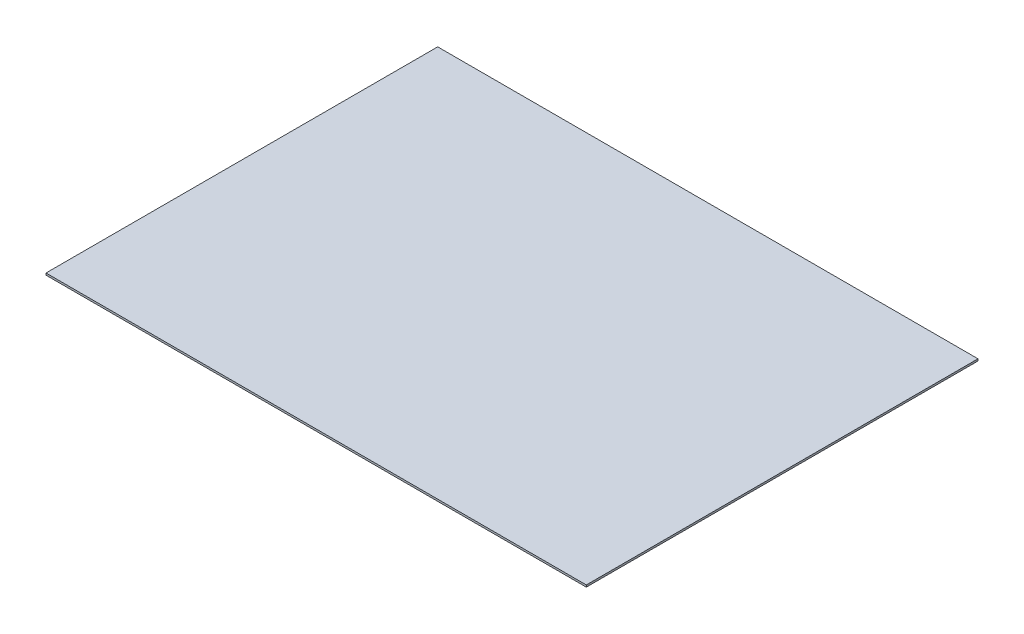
ISO-10303-21;
HEADER;
FILE_DESCRIPTION(('STEP AP214'),'2;1');
FILE_NAME('part.step','',(''),(''),'','','');
FILE_SCHEMA(('AUTOMOTIVE_DESIGN { 1 0 10303 214 1 1 1 1 }'));
ENDSEC;
DATA;
#1=APPLICATION_CONTEXT('core data for automotive mechanical design processes');
#2=APPLICATION_PROTOCOL_DEFINITION('international standard','automotive_design',2000,#1);
#3=PRODUCT_CONTEXT('',#1,'mechanical');
#4=PRODUCT('Part','Part','',(#3));
#5=PRODUCT_RELATED_PRODUCT_CATEGORY('part','',(#4));
#6=PRODUCT_DEFINITION_FORMATION('','',#4);
#7=PRODUCT_DEFINITION_CONTEXT('part definition',#1,'design');
#8=PRODUCT_DEFINITION('design','',#6,#7);
#9=PRODUCT_DEFINITION_SHAPE('','',#8);
#10=(LENGTH_UNIT() NAMED_UNIT(*) SI_UNIT(.MILLI.,.METRE.));
#11=(NAMED_UNIT(*) PLANE_ANGLE_UNIT() SI_UNIT($,.RADIAN.));
#12=(NAMED_UNIT(*) SI_UNIT($,.STERADIAN.) SOLID_ANGLE_UNIT());
#13=UNCERTAINTY_MEASURE_WITH_UNIT(LENGTH_MEASURE(1.E-05),#10,'distance_accuracy_value','');
#14=(GEOMETRIC_REPRESENTATION_CONTEXT(3) GLOBAL_UNCERTAINTY_ASSIGNED_CONTEXT((#13)) GLOBAL_UNIT_ASSIGNED_CONTEXT((#10,
#11,#12)) REPRESENTATION_CONTEXT('',''));
#15=CARTESIAN_POINT('',(0.,0.,0.));
#16=DIRECTION('',(0.,0.,1.));
#17=DIRECTION('',(1.,0.,0.));
#18=AXIS2_PLACEMENT_3D('',#15,#16,#17);
#19=CARTESIAN_POINT('',(-349.,1.24999999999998,253.));
#20=DIRECTION('',(1.,0.,0.));
#21=DIRECTION('',(0.,0.,-1.));
#22=AXIS2_PLACEMENT_3D('',#19,#20,#21);
#23=PLANE('',#22);
#24=DIRECTION('',(0.,-1.,0.));
#25=VECTOR('',#24,1.);
#26=CARTESIAN_POINT('',(-349.,1.24999999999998,-253.));
#27=LINE('',#26,#25);
#28=CARTESIAN_POINT('',(-349.,1.24999999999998,-253.));
#29=VERTEX_POINT('',#28);
#30=CARTESIAN_POINT('',(-349.,-1.25000000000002,-253.));
#31=VERTEX_POINT('',#30);
#32=EDGE_CURVE('E98',#29,#31,#27,.T.);
#33=ORIENTED_EDGE('',*,*,#32,.T.);
#34=DIRECTION('',(0.,0.,-1.));
#35=VECTOR('',#34,1.);
#36=CARTESIAN_POINT('',(-349.,-1.25000000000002,253.));
#37=LINE('',#36,#35);
#38=CARTESIAN_POINT('',(-349.,-1.25000000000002,253.));
#39=VERTEX_POINT('',#38);
#40=EDGE_CURVE('E11',#39,#31,#37,.T.);
#41=ORIENTED_EDGE('',*,*,#40,.F.);
#42=DIRECTION('',(0.,-1.,0.));
#43=VECTOR('',#42,1.);
#44=CARTESIAN_POINT('',(-349.,1.24999999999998,253.));
#45=LINE('',#44,#43);
#46=CARTESIAN_POINT('',(-349.,1.24999999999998,253.));
#47=VERTEX_POINT('',#46);
#48=EDGE_CURVE('E86',#47,#39,#45,.T.);
#49=ORIENTED_EDGE('',*,*,#48,.F.);
#50=DIRECTION('',(0.,0.,-1.));
#51=VECTOR('',#50,1.);
#52=CARTESIAN_POINT('',(-349.,1.24999999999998,253.));
#53=LINE('',#52,#51);
#54=EDGE_CURVE('E94',#47,#29,#53,.T.);
#55=ORIENTED_EDGE('',*,*,#54,.T.);
#56=EDGE_LOOP('',(#33,#41,#49,#55));
#57=FACE_BOUND('',#56,.T.);
#58=ADVANCED_FACE('F35',(#57),#23,.F.);
#59=CARTESIAN_POINT('',(-349.,-1.25000000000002,253.));
#60=DIRECTION('',(0.,1.,0.));
#61=DIRECTION('',(0.,0.,1.));
#62=AXIS2_PLACEMENT_3D('',#59,#60,#61);
#63=PLANE('',#62);
#64=DIRECTION('',(1.,0.,0.));
#65=VECTOR('',#64,1.);
#66=CARTESIAN_POINT('',(-349.,-1.25000000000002,-253.));
#67=LINE('',#66,#65);
#68=CARTESIAN_POINT('',(349.,-1.25000000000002,-253.));
#69=VERTEX_POINT('',#68);
#70=EDGE_CURVE('E90',#31,#69,#67,.T.);
#71=ORIENTED_EDGE('',*,*,#70,.T.);
#72=DIRECTION('',(0.,0.,-1.));
#73=VECTOR('',#72,1.);
#74=CARTESIAN_POINT('',(349.,-1.25000000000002,253.));
#75=LINE('',#74,#73);
#76=CARTESIAN_POINT('',(349.,-1.25000000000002,253.));
#77=VERTEX_POINT('',#76);
#78=EDGE_CURVE('E43',#77,#69,#75,.T.);
#79=ORIENTED_EDGE('',*,*,#78,.F.);
#80=DIRECTION('',(1.,0.,0.));
#81=VECTOR('',#80,1.);
#82=CARTESIAN_POINT('',(-349.,-1.25000000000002,253.));
#83=LINE('',#82,#81);
#84=EDGE_CURVE('E81',#39,#77,#83,.T.);
#85=ORIENTED_EDGE('',*,*,#84,.F.);
#86=ORIENTED_EDGE('',*,*,#40,.T.);
#87=EDGE_LOOP('',(#71,#79,#85,#86));
#88=FACE_BOUND('',#87,.T.);
#89=ADVANCED_FACE('F89',(#88),#63,.F.);
#90=CARTESIAN_POINT('',(349.,1.24999999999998,253.));
#91=DIRECTION('',(-1.,0.,0.));
#92=DIRECTION('',(0.,0.,1.));
#93=AXIS2_PLACEMENT_3D('',#90,#91,#92);
#94=PLANE('',#93);
#95=DIRECTION('',(0.,1.,0.));
#96=VECTOR('',#95,1.);
#97=CARTESIAN_POINT('',(349.,1.24999999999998,-253.));
#98=LINE('',#97,#96);
#99=CARTESIAN_POINT('',(349.,1.24999999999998,-253.));
#100=VERTEX_POINT('',#99);
#101=EDGE_CURVE('E68',#69,#100,#98,.T.);
#102=ORIENTED_EDGE('',*,*,#101,.T.);
#103=DIRECTION('',(0.,0.,-1.));
#104=VECTOR('',#103,1.);
#105=CARTESIAN_POINT('',(349.,1.24999999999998,253.));
#106=LINE('',#105,#104);
#107=CARTESIAN_POINT('',(349.,1.24999999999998,253.));
#108=VERTEX_POINT('',#107);
#109=EDGE_CURVE('E91',#108,#100,#106,.T.);
#110=ORIENTED_EDGE('',*,*,#109,.F.);
#111=DIRECTION('',(0.,1.,0.));
#112=VECTOR('',#111,1.);
#113=CARTESIAN_POINT('',(349.,1.24999999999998,253.));
#114=LINE('',#113,#112);
#115=EDGE_CURVE('E84',#77,#108,#114,.T.);
#116=ORIENTED_EDGE('',*,*,#115,.F.);
#117=ORIENTED_EDGE('',*,*,#78,.T.);
#118=EDGE_LOOP('',(#102,#110,#116,#117));
#119=FACE_BOUND('',#118,.T.);
#120=ADVANCED_FACE('F92',(#119),#94,.F.);
#121=CARTESIAN_POINT('',(-349.,1.24999999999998,253.));
#122=DIRECTION('',(0.,-1.,0.));
#123=DIRECTION('',(0.,0.,-1.));
#124=AXIS2_PLACEMENT_3D('',#121,#122,#123);
#125=PLANE('',#124);
#126=DIRECTION('',(-1.,0.,0.));
#127=VECTOR('',#126,1.);
#128=CARTESIAN_POINT('',(-349.,1.24999999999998,-253.));
#129=LINE('',#128,#127);
#130=EDGE_CURVE('E74',#100,#29,#129,.T.);
#131=ORIENTED_EDGE('',*,*,#130,.T.);
#132=ORIENTED_EDGE('',*,*,#54,.F.);
#133=DIRECTION('',(-1.,0.,0.));
#134=VECTOR('',#133,1.);
#135=CARTESIAN_POINT('',(-349.,1.24999999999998,253.));
#136=LINE('',#135,#134);
#137=EDGE_CURVE('E51',#108,#47,#136,.T.);
#138=ORIENTED_EDGE('',*,*,#137,.F.);
#139=ORIENTED_EDGE('',*,*,#109,.T.);
#140=EDGE_LOOP('',(#131,#132,#138,#139));
#141=FACE_BOUND('',#140,.T.);
#142=ADVANCED_FACE('F105',(#141),#125,.F.);
#143=CARTESIAN_POINT('',(-349.,-1.25000000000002,253.));
#144=DIRECTION('',(0.,0.,1.));
#145=DIRECTION('',(1.,0.,0.));
#146=AXIS2_PLACEMENT_3D('',#143,#144,#145);
#147=PLANE('',#146);
#148=ORIENTED_EDGE('',*,*,#48,.T.);
#149=ORIENTED_EDGE('',*,*,#84,.T.);
#150=ORIENTED_EDGE('',*,*,#115,.T.);
#151=ORIENTED_EDGE('',*,*,#137,.T.);
#152=EDGE_LOOP('',(#148,#149,#150,#151));
#153=FACE_BOUND('',#152,.T.);
#154=ADVANCED_FACE('F82',(#153),#147,.T.);
#155=CARTESIAN_POINT('',(-349.,-1.25000000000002,-253.));
#156=DIRECTION('',(0.,0.,1.));
#157=DIRECTION('',(1.,0.,0.));
#158=AXIS2_PLACEMENT_3D('',#155,#156,#157);
#159=PLANE('',#158);
#160=ORIENTED_EDGE('',*,*,#32,.F.);
#161=ORIENTED_EDGE('',*,*,#130,.F.);
#162=ORIENTED_EDGE('',*,*,#101,.F.);
#163=ORIENTED_EDGE('',*,*,#70,.F.);
#164=EDGE_LOOP('',(#160,#161,#162,#163));
#165=FACE_BOUND('',#164,.T.);
#166=ADVANCED_FACE('F108',(#165),#159,.F.);
#167=CLOSED_SHELL('',(#58,#89,#120,#142,#154,#166));
#168=MANIFOLD_SOLID_BREP('B2',#167);
#169=ADVANCED_BREP_SHAPE_REPRESENTATION('',(#18,#168),#14);
#170=SHAPE_DEFINITION_REPRESENTATION(#9,#169);
ENDSEC;
END-ISO-10303-21;
